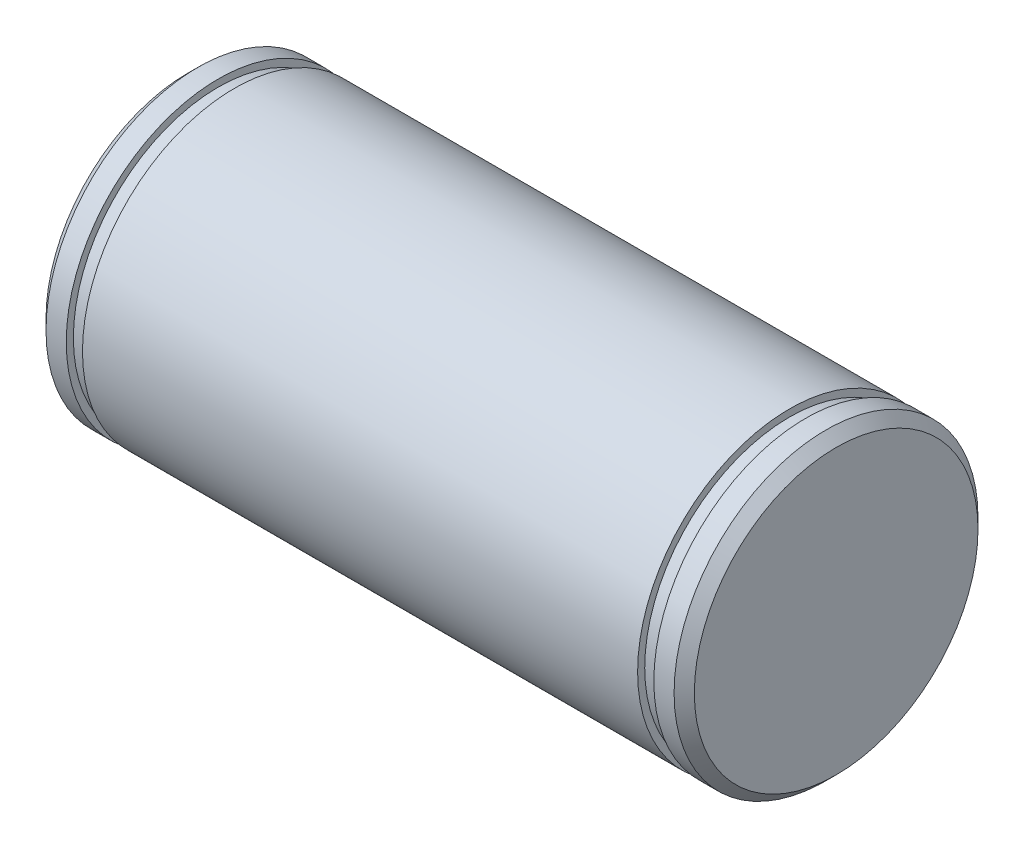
ISO-10303-21;
HEADER;
FILE_DESCRIPTION(('STEP AP214'),'2;1');
FILE_NAME('part.step','',(''),(''),'','','');
FILE_SCHEMA(('AUTOMOTIVE_DESIGN { 1 0 10303 214 1 1 1 1 }'));
ENDSEC;
DATA;
#1=APPLICATION_CONTEXT('core data for automotive mechanical design processes');
#2=APPLICATION_PROTOCOL_DEFINITION('international standard','automotive_design',2000,#1);
#3=PRODUCT_CONTEXT('',#1,'mechanical');
#4=PRODUCT('Part','Part','',(#3));
#5=PRODUCT_RELATED_PRODUCT_CATEGORY('part','',(#4));
#6=PRODUCT_DEFINITION_FORMATION('','',#4);
#7=PRODUCT_DEFINITION_CONTEXT('part definition',#1,'design');
#8=PRODUCT_DEFINITION('design','',#6,#7);
#9=PRODUCT_DEFINITION_SHAPE('','',#8);
#10=(LENGTH_UNIT() NAMED_UNIT(*) SI_UNIT(.MILLI.,.METRE.));
#11=(NAMED_UNIT(*) PLANE_ANGLE_UNIT() SI_UNIT($,.RADIAN.));
#12=(NAMED_UNIT(*) SI_UNIT($,.STERADIAN.) SOLID_ANGLE_UNIT());
#13=UNCERTAINTY_MEASURE_WITH_UNIT(LENGTH_MEASURE(1.E-05),#10,'distance_accuracy_value','');
#14=(GEOMETRIC_REPRESENTATION_CONTEXT(3) GLOBAL_UNCERTAINTY_ASSIGNED_CONTEXT((#13)) GLOBAL_UNIT_ASSIGNED_CONTEXT((#10,
#11,#12)) REPRESENTATION_CONTEXT('',''));
#15=CARTESIAN_POINT('',(0.,0.,0.));
#16=DIRECTION('',(0.,0.,1.));
#17=DIRECTION('',(1.,0.,0.));
#18=AXIS2_PLACEMENT_3D('',#15,#16,#17);
#19=CARTESIAN_POINT('',(-16.9470782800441,9.31593776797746,0.));
#20=DIRECTION('',(1.,0.,0.));
#21=DIRECTION('',(0.,0.,-1.));
#22=AXIS2_PLACEMENT_3D('',#19,#20,#21);
#23=PLANE('',#22);
#24=CARTESIAN_POINT('',(-16.9470782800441,9.31593776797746,0.));
#25=DIRECTION('',(-1.,0.,0.));
#26=DIRECTION('',(0.,0.,1.));
#27=AXIS2_PLACEMENT_3D('',#24,#25,#26);
#28=CIRCLE('',#27,14.);
#29=CARTESIAN_POINT('',(-16.9470782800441,9.31593776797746,14.));
#30=VERTEX_POINT('',#29);
#31=EDGE_CURVE('E10',#30,#30,#28,.T.);
#32=ORIENTED_EDGE('',*,*,#31,.T.);
#33=EDGE_LOOP('',(#32));
#34=FACE_BOUND('',#33,.T.);
#35=ADVANCED_FACE('F30',(#34),#23,.F.);
#36=CARTESIAN_POINT('',(-15.9470782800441,9.31593776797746,0.));
#37=DIRECTION('',(1.,0.,0.));
#38=DIRECTION('',(0.,0.,-1.));
#39=AXIS2_PLACEMENT_3D('',#36,#37,#38);
#40=CONICAL_SURFACE('',#39,15.,0.785398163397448);
#41=ORIENTED_EDGE('',*,*,#31,.F.);
#42=EDGE_LOOP('',(#41));
#43=FACE_BOUND('',#42,.T.);
#44=CARTESIAN_POINT('',(-15.9470782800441,9.31593776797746,0.));
#45=DIRECTION('',(-1.,0.,0.));
#46=DIRECTION('',(0.,0.,1.));
#47=AXIS2_PLACEMENT_3D('',#44,#45,#46);
#48=CIRCLE('',#47,15.);
#49=CARTESIAN_POINT('',(-15.9470782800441,9.31593776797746,15.));
#50=VERTEX_POINT('',#49);
#51=EDGE_CURVE('E36',#50,#50,#48,.T.);
#52=ORIENTED_EDGE('',*,*,#51,.T.);
#53=EDGE_LOOP('',(#52));
#54=FACE_BOUND('',#53,.T.);
#55=ADVANCED_FACE('F86',(#43,#54),#40,.T.);
#56=CARTESIAN_POINT('',(-28.2451304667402,9.31593776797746,0.));
#57=DIRECTION('',(-1.,0.,0.));
#58=DIRECTION('',(0.,0.,1.));
#59=AXIS2_PLACEMENT_3D('',#56,#57,#58);
#60=CYLINDRICAL_SURFACE('',#59,15.);
#61=ORIENTED_EDGE('',*,*,#51,.F.);
#62=EDGE_LOOP('',(#61));
#63=FACE_BOUND('',#62,.T.);
#64=CARTESIAN_POINT('',(-13.9470782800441,9.31593776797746,0.));
#65=DIRECTION('',(-1.,0.,0.));
#66=DIRECTION('',(0.,0.,1.));
#67=AXIS2_PLACEMENT_3D('',#64,#65,#66);
#68=CIRCLE('',#67,15.);
#69=CARTESIAN_POINT('',(-13.9470782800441,9.31593776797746,15.));
#70=VERTEX_POINT('',#69);
#71=EDGE_CURVE('E40',#70,#70,#68,.T.);
#72=ORIENTED_EDGE('',*,*,#71,.T.);
#73=EDGE_LOOP('',(#72));
#74=FACE_BOUND('',#73,.T.);
#75=ADVANCED_FACE('F90',(#63,#74),#60,.T.);
#76=CARTESIAN_POINT('',(-13.9470782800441,24.3159377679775,0.));
#77=DIRECTION('',(-1.,0.,0.));
#78=DIRECTION('',(0.,0.,1.));
#79=AXIS2_PLACEMENT_3D('',#76,#77,#78);
#80=PLANE('',#79);
#81=ORIENTED_EDGE('',*,*,#71,.F.);
#82=EDGE_LOOP('',(#81));
#83=FACE_BOUND('',#82,.T.);
#84=CARTESIAN_POINT('',(-13.9470782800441,9.31593776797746,0.));
#85=DIRECTION('',(-1.,0.,0.));
#86=DIRECTION('',(0.,0.,1.));
#87=AXIS2_PLACEMENT_3D('',#84,#85,#86);
#88=CIRCLE('',#87,14.3);
#89=CARTESIAN_POINT('',(-13.9470782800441,9.31593776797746,14.3));
#90=VERTEX_POINT('',#89);
#91=EDGE_CURVE('E44',#90,#90,#88,.T.);
#92=ORIENTED_EDGE('',*,*,#91,.T.);
#93=EDGE_LOOP('',(#92));
#94=FACE_BOUND('',#93,.T.);
#95=ADVANCED_FACE('F95',(#83,#94),#80,.F.);
#96=CARTESIAN_POINT('',(-28.2451304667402,9.31593776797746,0.));
#97=DIRECTION('',(-1.,0.,0.));
#98=DIRECTION('',(0.,0.,1.));
#99=AXIS2_PLACEMENT_3D('',#96,#97,#98);
#100=CYLINDRICAL_SURFACE('',#99,14.3);
#101=ORIENTED_EDGE('',*,*,#91,.F.);
#102=EDGE_LOOP('',(#101));
#103=FACE_BOUND('',#102,.T.);
#104=CARTESIAN_POINT('',(-12.3470782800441,9.31593776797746,0.));
#105=DIRECTION('',(-1.,0.,0.));
#106=DIRECTION('',(0.,0.,1.));
#107=AXIS2_PLACEMENT_3D('',#104,#105,#106);
#108=CIRCLE('',#107,14.3);
#109=CARTESIAN_POINT('',(-12.3470782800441,9.31593776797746,14.3));
#110=VERTEX_POINT('',#109);
#111=EDGE_CURVE('E49',#110,#110,#108,.T.);
#112=ORIENTED_EDGE('',*,*,#111,.T.);
#113=EDGE_LOOP('',(#112));
#114=FACE_BOUND('',#113,.T.);
#115=ADVANCED_FACE('F101',(#103,#114),#100,.T.);
#116=CARTESIAN_POINT('',(-12.3470782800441,24.3159377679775,0.));
#117=DIRECTION('',(1.,0.,0.));
#118=DIRECTION('',(0.,0.,-1.));
#119=AXIS2_PLACEMENT_3D('',#116,#117,#118);
#120=PLANE('',#119);
#121=ORIENTED_EDGE('',*,*,#111,.F.);
#122=EDGE_LOOP('',(#121));
#123=FACE_BOUND('',#122,.T.);
#124=CARTESIAN_POINT('',(-12.3470782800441,9.31593776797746,0.));
#125=DIRECTION('',(-1.,0.,0.));
#126=DIRECTION('',(0.,0.,1.));
#127=AXIS2_PLACEMENT_3D('',#124,#125,#126);
#128=CIRCLE('',#127,15.);
#129=CARTESIAN_POINT('',(-12.3470782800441,9.31593776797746,15.));
#130=VERTEX_POINT('',#129);
#131=EDGE_CURVE('E52',#130,#130,#128,.T.);
#132=ORIENTED_EDGE('',*,*,#131,.T.);
#133=EDGE_LOOP('',(#132));
#134=FACE_BOUND('',#133,.T.);
#135=ADVANCED_FACE('F105',(#123,#134),#120,.F.);
#136=CARTESIAN_POINT('',(-28.2451304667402,9.31593776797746,0.));
#137=DIRECTION('',(-1.,0.,0.));
#138=DIRECTION('',(0.,0.,1.));
#139=AXIS2_PLACEMENT_3D('',#136,#137,#138);
#140=CYLINDRICAL_SURFACE('',#139,15.);
#141=ORIENTED_EDGE('',*,*,#131,.F.);
#142=EDGE_LOOP('',(#141));
#143=FACE_BOUND('',#142,.T.);
#144=CARTESIAN_POINT('',(42.4529217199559,9.31593776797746,0.));
#145=DIRECTION('',(-1.,0.,0.));
#146=DIRECTION('',(0.,0.,1.));
#147=AXIS2_PLACEMENT_3D('',#144,#145,#146);
#148=CIRCLE('',#147,15.);
#149=CARTESIAN_POINT('',(42.4529217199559,9.31593776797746,15.));
#150=VERTEX_POINT('',#149);
#151=EDGE_CURVE('E55',#150,#150,#148,.T.);
#152=ORIENTED_EDGE('',*,*,#151,.T.);
#153=EDGE_LOOP('',(#152));
#154=FACE_BOUND('',#153,.T.);
#155=ADVANCED_FACE('F109',(#143,#154),#140,.T.);
#156=CARTESIAN_POINT('',(42.4529217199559,24.3159377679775,0.));
#157=DIRECTION('',(-1.,0.,0.));
#158=DIRECTION('',(0.,0.,1.));
#159=AXIS2_PLACEMENT_3D('',#156,#157,#158);
#160=PLANE('',#159);
#161=ORIENTED_EDGE('',*,*,#151,.F.);
#162=EDGE_LOOP('',(#161));
#163=FACE_BOUND('',#162,.T.);
#164=CARTESIAN_POINT('',(42.4529217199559,9.31593776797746,0.));
#165=DIRECTION('',(-1.,0.,0.));
#166=DIRECTION('',(0.,0.,1.));
#167=AXIS2_PLACEMENT_3D('',#164,#165,#166);
#168=CIRCLE('',#167,14.3);
#169=CARTESIAN_POINT('',(42.4529217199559,9.31593776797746,14.3));
#170=VERTEX_POINT('',#169);
#171=EDGE_CURVE('E58',#170,#170,#168,.T.);
#172=ORIENTED_EDGE('',*,*,#171,.T.);
#173=EDGE_LOOP('',(#172));
#174=FACE_BOUND('',#173,.T.);
#175=ADVANCED_FACE('F113',(#163,#174),#160,.F.);
#176=CARTESIAN_POINT('',(-28.2451304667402,9.31593776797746,0.));
#177=DIRECTION('',(-1.,0.,0.));
#178=DIRECTION('',(0.,0.,1.));
#179=AXIS2_PLACEMENT_3D('',#176,#177,#178);
#180=CYLINDRICAL_SURFACE('',#179,14.3);
#181=ORIENTED_EDGE('',*,*,#171,.F.);
#182=EDGE_LOOP('',(#181));
#183=FACE_BOUND('',#182,.T.);
#184=CARTESIAN_POINT('',(44.0529217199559,9.31593776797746,0.));
#185=DIRECTION('',(-1.,0.,0.));
#186=DIRECTION('',(0.,0.,1.));
#187=AXIS2_PLACEMENT_3D('',#184,#185,#186);
#188=CIRCLE('',#187,14.3);
#189=CARTESIAN_POINT('',(44.0529217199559,9.31593776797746,14.3));
#190=VERTEX_POINT('',#189);
#191=EDGE_CURVE('E61',#190,#190,#188,.T.);
#192=ORIENTED_EDGE('',*,*,#191,.T.);
#193=EDGE_LOOP('',(#192));
#194=FACE_BOUND('',#193,.T.);
#195=ADVANCED_FACE('F117',(#183,#194),#180,.T.);
#196=CARTESIAN_POINT('',(44.0529217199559,24.3159377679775,0.));
#197=DIRECTION('',(1.,0.,0.));
#198=DIRECTION('',(0.,0.,-1.));
#199=AXIS2_PLACEMENT_3D('',#196,#197,#198);
#200=PLANE('',#199);
#201=ORIENTED_EDGE('',*,*,#191,.F.);
#202=EDGE_LOOP('',(#201));
#203=FACE_BOUND('',#202,.T.);
#204=CARTESIAN_POINT('',(44.0529217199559,9.31593776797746,0.));
#205=DIRECTION('',(-1.,0.,0.));
#206=DIRECTION('',(0.,0.,1.));
#207=AXIS2_PLACEMENT_3D('',#204,#205,#206);
#208=CIRCLE('',#207,15.);
#209=CARTESIAN_POINT('',(44.0529217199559,9.31593776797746,15.));
#210=VERTEX_POINT('',#209);
#211=EDGE_CURVE('E64',#210,#210,#208,.T.);
#212=ORIENTED_EDGE('',*,*,#211,.T.);
#213=EDGE_LOOP('',(#212));
#214=FACE_BOUND('',#213,.T.);
#215=ADVANCED_FACE('F121',(#203,#214),#200,.F.);
#216=CARTESIAN_POINT('',(-28.2451304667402,9.31593776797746,0.));
#217=DIRECTION('',(-1.,0.,0.));
#218=DIRECTION('',(0.,0.,1.));
#219=AXIS2_PLACEMENT_3D('',#216,#217,#218);
#220=CYLINDRICAL_SURFACE('',#219,15.);
#221=ORIENTED_EDGE('',*,*,#211,.F.);
#222=EDGE_LOOP('',(#221));
#223=FACE_BOUND('',#222,.T.);
#224=CARTESIAN_POINT('',(46.0529217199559,9.31593776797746,0.));
#225=DIRECTION('',(-1.,0.,0.));
#226=DIRECTION('',(0.,0.,1.));
#227=AXIS2_PLACEMENT_3D('',#224,#225,#226);
#228=CIRCLE('',#227,15.);
#229=CARTESIAN_POINT('',(46.0529217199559,9.31593776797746,15.));
#230=VERTEX_POINT('',#229);
#231=EDGE_CURVE('E67',#230,#230,#228,.T.);
#232=ORIENTED_EDGE('',*,*,#231,.T.);
#233=EDGE_LOOP('',(#232));
#234=FACE_BOUND('',#233,.T.);
#235=ADVANCED_FACE('F82',(#223,#234),#220,.T.);
#236=CARTESIAN_POINT('',(47.0529217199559,9.31593776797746,0.));
#237=DIRECTION('',(-1.,0.,0.));
#238=DIRECTION('',(0.,0.,1.));
#239=AXIS2_PLACEMENT_3D('',#236,#237,#238);
#240=CONICAL_SURFACE('',#239,14.,0.785398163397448);
#241=ORIENTED_EDGE('',*,*,#231,.F.);
#242=EDGE_LOOP('',(#241));
#243=FACE_BOUND('',#242,.T.);
#244=CARTESIAN_POINT('',(47.0529217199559,9.31593776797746,0.));
#245=DIRECTION('',(-1.,0.,0.));
#246=DIRECTION('',(0.,0.,1.));
#247=AXIS2_PLACEMENT_3D('',#244,#245,#246);
#248=CIRCLE('',#247,14.);
#249=CARTESIAN_POINT('',(47.0529217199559,9.31593776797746,14.));
#250=VERTEX_POINT('',#249);
#251=EDGE_CURVE('E70',#250,#250,#248,.T.);
#252=ORIENTED_EDGE('',*,*,#251,.T.);
#253=EDGE_LOOP('',(#252));
#254=FACE_BOUND('',#253,.T.);
#255=ADVANCED_FACE('F74',(#243,#254),#240,.T.);
#256=CARTESIAN_POINT('',(47.0529217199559,9.31593776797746,0.));
#257=DIRECTION('',(-1.,0.,0.));
#258=DIRECTION('',(0.,0.,1.));
#259=AXIS2_PLACEMENT_3D('',#256,#257,#258);
#260=PLANE('',#259);
#261=ORIENTED_EDGE('',*,*,#251,.F.);
#262=EDGE_LOOP('',(#261));
#263=FACE_BOUND('',#262,.T.);
#264=ADVANCED_FACE('F76',(#263),#260,.F.);
#265=CLOSED_SHELL('',(#35,#55,#75,#95,#115,#135,#155,#175,#195,#215,#235,#255,#264));
#266=MANIFOLD_SOLID_BREP('B2',#265);
#267=ADVANCED_BREP_SHAPE_REPRESENTATION('',(#18,#266),#14);
#268=SHAPE_DEFINITION_REPRESENTATION(#9,#267);
ENDSEC;
END-ISO-10303-21;
